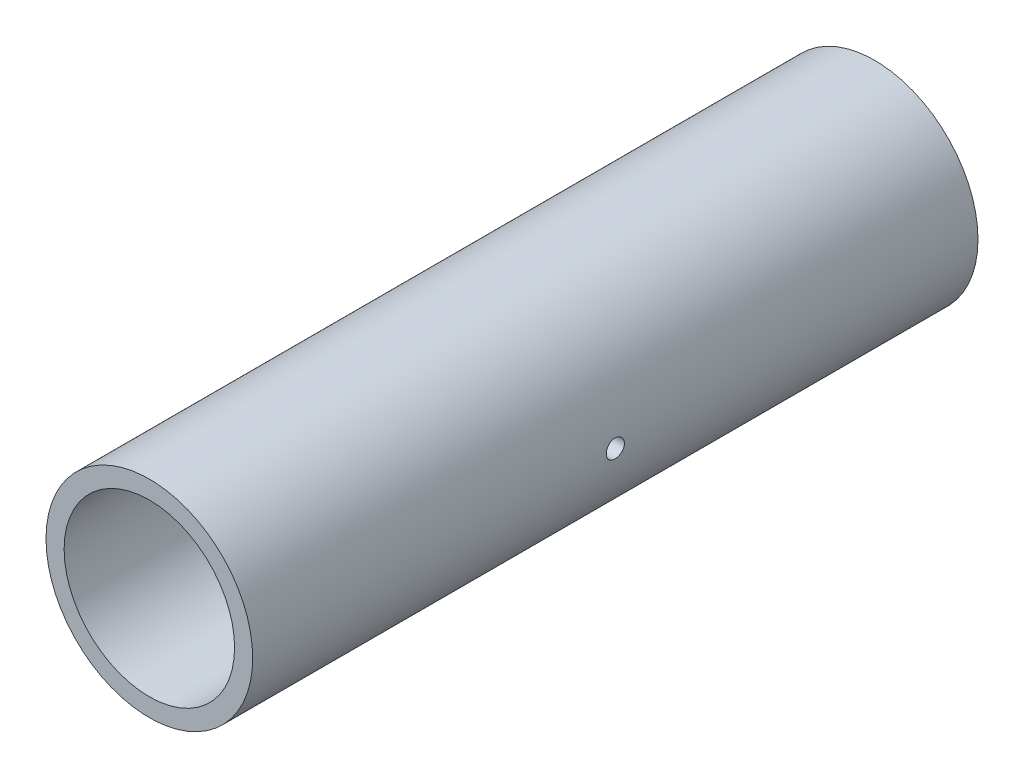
from build123d import *

# Parameters (mm, degrees)
SKETCH1_R              = 28.5
SKETCH1_R_2            = 23.5
BOSS_EXTRUDE1_DEPTH    = 200
M6_TAPPED_HOLE1_REACH  = 211.908
M6_TAPPED_HOLE1_BORE_R = 2.5


with BuildPart() as part:
    # Sketch1 → Boss-Extrude1 (new body)
    with BuildSketch(Plane.XY):
        Circle(SKETCH1_R)
        Circle(SKETCH1_R_2, mode=Mode.SUBTRACT)
    extrude(amount=BOSS_EXTRUDE1_DEPTH)

    # M6 Tapped Hole1 bore → M6 Tapped Hole1 (cut, up to next)
    with BuildSketch(Plane(origin=(28.5, 0, 0), x_dir=(0, 0, -1), z_dir=(1, 0, 0)), mode=Mode.PRIVATE) as m6_tapped_hole1_sk1:
        with Locations((-100, 0)):
            Circle(M6_TAPPED_HOLE1_BORE_R)
    m6_tapped_hole1_tool1 = extrude(m6_tapped_hole1_sk1.sketch, amount=-M6_TAPPED_HOLE1_REACH, mode=Mode.PRIVATE) & part.part
    add(m6_tapped_hole1_tool1.solids().sort_by_distance((28.5, 0, 100))[0], mode=Mode.SUBTRACT)


solid = part.part
